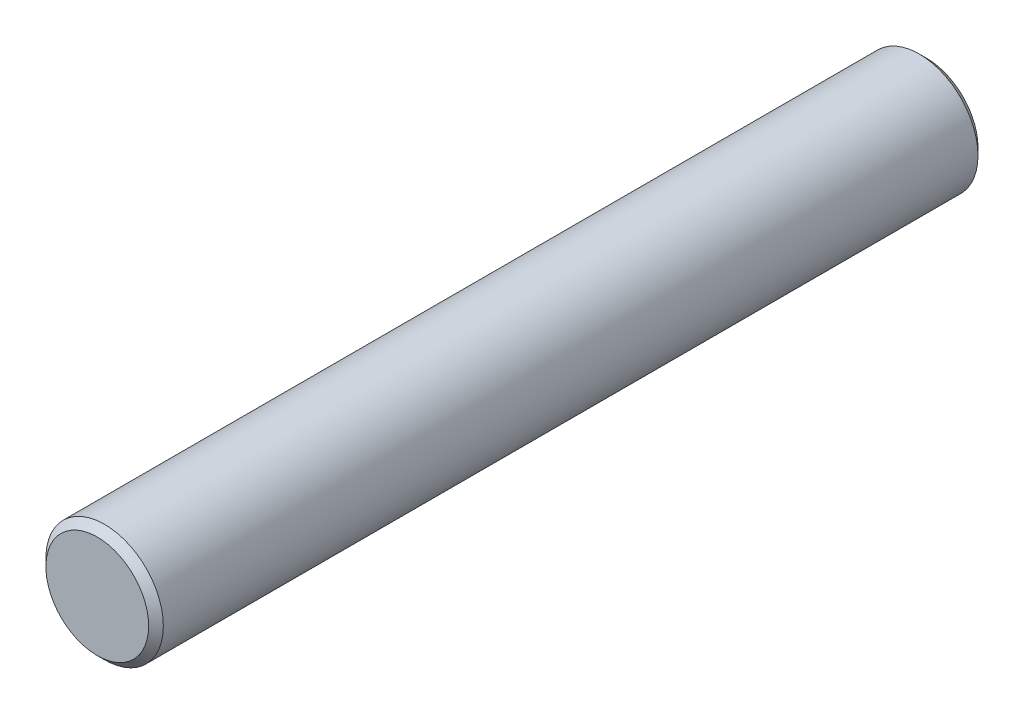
from build123d import *


with BuildPart() as part:
    # Esquisse1 → Base-R_volution (revolve)
    with BuildSketch(Plane(origin=(0, 0, 0), x_dir=(0, 0, -1), z_dir=(1, 0, 0)), mode=Mode.PRIVATE) as base_r_volution_sk:
        Polygon((-27.75, 4), (27.75, 4), (28.25, 3.5), (28.25, 0), (-28.25, 0), (-28.25, 3.5), align=None)
    revolve(base_r_volution_sk.sketch.rotate(Axis((0, 0, 35.5), (0, 0, -1)), 90), axis=Axis((0, 0, 35.5), (0, 0, -1)))


solid = part.part
